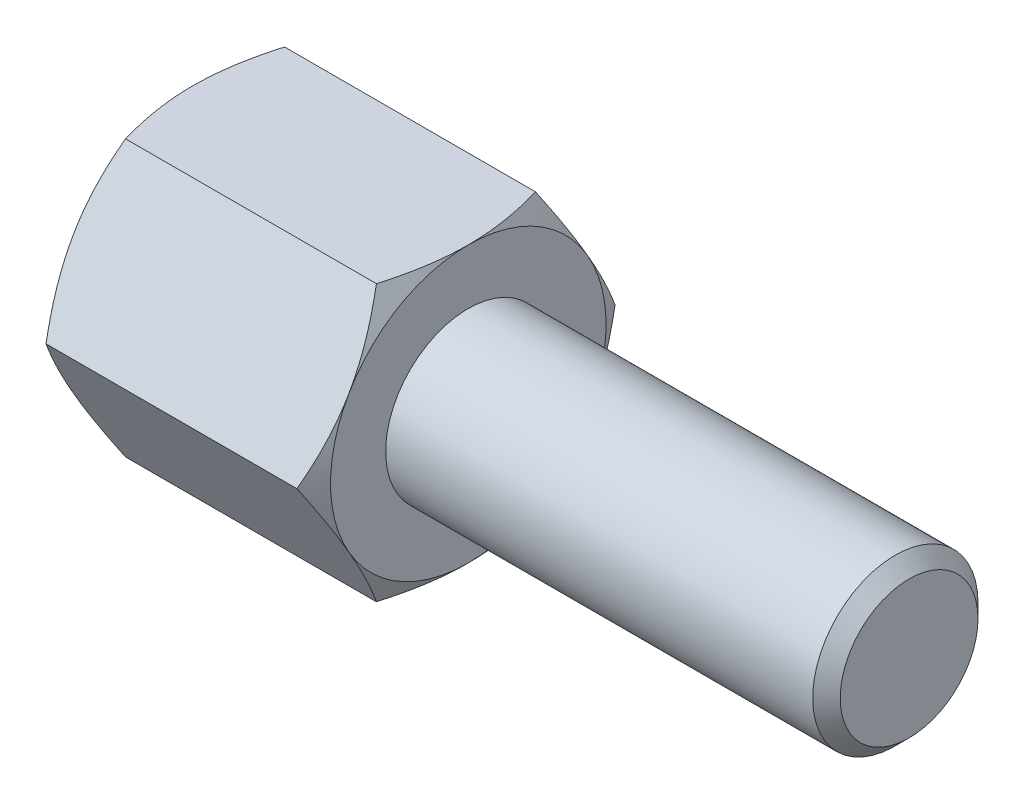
ISO-10303-21;
HEADER;
FILE_DESCRIPTION(('STEP AP214'),'2;1');
FILE_NAME('part.step','',(''),(''),'','','');
FILE_SCHEMA(('AUTOMOTIVE_DESIGN { 1 0 10303 214 1 1 1 1 }'));
ENDSEC;
DATA;
#1=APPLICATION_CONTEXT('core data for automotive mechanical design processes');
#2=APPLICATION_PROTOCOL_DEFINITION('international standard','automotive_design',2000,#1);
#3=PRODUCT_CONTEXT('',#1,'mechanical');
#4=PRODUCT('Part','Part','',(#3));
#5=PRODUCT_RELATED_PRODUCT_CATEGORY('part','',(#4));
#6=PRODUCT_DEFINITION_FORMATION('','',#4);
#7=PRODUCT_DEFINITION_CONTEXT('part definition',#1,'design');
#8=PRODUCT_DEFINITION('design','',#6,#7);
#9=PRODUCT_DEFINITION_SHAPE('','',#8);
#10=(LENGTH_UNIT() NAMED_UNIT(*) SI_UNIT(.MILLI.,.METRE.));
#11=(NAMED_UNIT(*) PLANE_ANGLE_UNIT() SI_UNIT($,.RADIAN.));
#12=(NAMED_UNIT(*) SI_UNIT($,.STERADIAN.) SOLID_ANGLE_UNIT());
#13=UNCERTAINTY_MEASURE_WITH_UNIT(LENGTH_MEASURE(1.E-05),#10,'distance_accuracy_value','');
#14=(GEOMETRIC_REPRESENTATION_CONTEXT(3) GLOBAL_UNCERTAINTY_ASSIGNED_CONTEXT((#13)) GLOBAL_UNIT_ASSIGNED_CONTEXT((#10,
#11,#12)) REPRESENTATION_CONTEXT('',''));
#15=CARTESIAN_POINT('',(0.,0.,0.));
#16=DIRECTION('',(0.,0.,1.));
#17=DIRECTION('',(1.,0.,0.));
#18=AXIS2_PLACEMENT_3D('',#15,#16,#17);
#19=CARTESIAN_POINT('',(2.5,2.5,-1.44337567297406));
#20=DIRECTION('',(1.,0.,0.));
#21=DIRECTION('',(0.,0.,-1.));
#22=AXIS2_PLACEMENT_3D('',#19,#20,#21);
#23=PLANE('',#22);
#24=CARTESIAN_POINT('',(2.5,0.,0.));
#25=DIRECTION('',(1.,0.,0.));
#26=DIRECTION('',(0.,0.,-1.));
#27=AXIS2_PLACEMENT_3D('',#24,#25,#26);
#28=CIRCLE('',#27,2.5);
#29=CARTESIAN_POINT('',(2.5,-1.25,-2.1650635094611));
#30=VERTEX_POINT('',#29);
#31=CARTESIAN_POINT('',(2.5,1.25,-2.1650635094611));
#32=VERTEX_POINT('',#31);
#33=EDGE_CURVE('E288',#30,#32,#28,.T.);
#34=ORIENTED_EDGE('',*,*,#33,.T.);
#35=CARTESIAN_POINT('',(2.5,2.5,0.));
#36=VERTEX_POINT('',#35);
#37=EDGE_CURVE('E53',#32,#36,#28,.T.);
#38=ORIENTED_EDGE('',*,*,#37,.T.);
#39=CARTESIAN_POINT('',(2.5,1.25,2.1650635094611));
#40=VERTEX_POINT('',#39);
#41=EDGE_CURVE('E297',#36,#40,#28,.T.);
#42=ORIENTED_EDGE('',*,*,#41,.T.);
#43=CARTESIAN_POINT('',(2.5,-1.25,2.1650635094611));
#44=VERTEX_POINT('',#43);
#45=EDGE_CURVE('E302',#40,#44,#28,.T.);
#46=ORIENTED_EDGE('',*,*,#45,.T.);
#47=CARTESIAN_POINT('',(2.5,0.,0.));
#48=DIRECTION('',(-1.,0.,0.));
#49=DIRECTION('',(0.,-1.,0.));
#50=AXIS2_PLACEMENT_3D('',#47,#48,#49);
#51=CIRCLE('',#50,2.5);
#52=CARTESIAN_POINT('',(2.5,-2.5,0.));
#53=VERTEX_POINT('',#52);
#54=EDGE_CURVE('E193',#53,#44,#51,.T.);
#55=ORIENTED_EDGE('',*,*,#54,.F.);
#56=EDGE_CURVE('E61',#53,#30,#28,.T.);
#57=ORIENTED_EDGE('',*,*,#56,.T.);
#58=EDGE_LOOP('',(#34,#38,#42,#46,#55,#57));
#59=FACE_BOUND('',#58,.T.);
#60=CARTESIAN_POINT('',(2.5,0.,0.));
#61=DIRECTION('',(1.,0.,0.));
#62=DIRECTION('',(0.,0.,-1.));
#63=AXIS2_PLACEMENT_3D('',#60,#61,#62);
#64=CIRCLE('',#63,1.5);
#65=CARTESIAN_POINT('',(2.5,0.,-1.5));
#66=VERTEX_POINT('',#65);
#67=EDGE_CURVE('E314',#66,#66,#64,.T.);
#68=ORIENTED_EDGE('',*,*,#67,.F.);
#69=EDGE_LOOP('',(#68));
#70=FACE_BOUND('',#69,.T.);
#71=ADVANCED_FACE('F37',(#59,#70),#23,.T.);
#72=CARTESIAN_POINT('',(2.5,0.,-2.88675134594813));
#73=DIRECTION('',(0.,-0.5,0.866025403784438));
#74=DIRECTION('',(0.,-0.866025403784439,-0.5));
#75=AXIS2_PLACEMENT_3D('',#72,#73,#74);
#76=PLANE('',#75);
#77=CARTESIAN_POINT('',(2.27664233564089,-0.000199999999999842,-2.88686681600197));
#78=CARTESIAN_POINT('',(2.31327837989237,0.109663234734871,-2.82343724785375));
#79=CARTESIAN_POINT('',(2.34659778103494,0.220474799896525,-2.75946016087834));
#80=CARTESIAN_POINT('',(2.40475771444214,0.444016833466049,-2.63039810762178));
#81=CARTESIAN_POINT('',(2.42957767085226,0.556751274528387,-2.5653108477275));
#82=CARTESIAN_POINT('',(2.46821434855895,0.780822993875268,-2.43594298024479));
#83=CARTESIAN_POINT('',(2.48228820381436,0.892125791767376,-2.37168227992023));
#84=CARTESIAN_POINT('',(2.49909084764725,1.11525522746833,-2.24285844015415));
#85=CARTESIAN_POINT('',(2.50183354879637,1.22708105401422,-2.17829576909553));
#86=CARTESIAN_POINT('',(2.49613423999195,1.43604197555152,-2.05765212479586));
#87=CARTESIAN_POINT('',(2.48909160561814,1.53320831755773,-2.0015531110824));
#88=CARTESIAN_POINT('',(2.46676858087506,1.726907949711,-1.88972057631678));
#89=CARTESIAN_POINT('',(2.45148056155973,1.82344056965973,-1.8339874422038));
#90=CARTESIAN_POINT('',(2.41326090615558,2.01753972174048,-1.7219242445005));
#91=CARTESIAN_POINT('',(2.39016722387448,2.11508168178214,-1.66560836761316));
#92=CARTESIAN_POINT('',(2.33775334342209,2.30871060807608,-1.55381665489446));
#93=CARTESIAN_POINT('',(2.30844546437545,2.40480005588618,-1.49833938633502));
#94=CARTESIAN_POINT('',(2.27664233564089,2.5002,-1.44326020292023));
#95=B_SPLINE_CURVE_WITH_KNOTS('',3,(#77,#78,#79,#80,#81,#82,#83,#84,#85,#86,#87,#88,#89,#90,#91,
#92,#93,#94),.UNSPECIFIED.,.F.,.F.,(4,2,2,2,2,2,2,2,4),(0.,0.396285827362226,0.79352433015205,
1.18093086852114,1.56786160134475,1.90479741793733,2.24204551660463,2.58677531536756,
2.93082800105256),.UNSPECIFIED.);
#96=CARTESIAN_POINT('',(2.2767090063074,0.,-2.88675134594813));
#97=VERTEX_POINT('',#96);
#98=EDGE_CURVE('E330',#97,#32,#95,.T.);
#99=ORIENTED_EDGE('',*,*,#98,.F.);
#100=DIRECTION('',(-1.,0.,0.));
#101=VECTOR('',#100,1.);
#102=CARTESIAN_POINT('',(2.5,0.,-2.88675134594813));
#103=LINE('',#102,#101);
#104=CARTESIAN_POINT('',(-2.2767090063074,0.,-2.88675134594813));
#105=VERTEX_POINT('',#104);
#106=EDGE_CURVE('E264',#97,#105,#103,.T.);
#107=ORIENTED_EDGE('',*,*,#106,.T.);
#108=CARTESIAN_POINT('',(-2.27664233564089,2.5002,-1.44326020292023));
#109=CARTESIAN_POINT('',(-2.31327837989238,2.39033676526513,-1.50668977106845));
#110=CARTESIAN_POINT('',(-2.34659778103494,2.27952520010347,-1.57066685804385));
#111=CARTESIAN_POINT('',(-2.40475771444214,2.05598316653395,-1.69972891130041));
#112=CARTESIAN_POINT('',(-2.42957767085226,1.94324872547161,-1.7648161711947));
#113=CARTESIAN_POINT('',(-2.46821434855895,1.71917700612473,-1.8941840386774));
#114=CARTESIAN_POINT('',(-2.48228820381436,1.60787420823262,-1.95844473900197));
#115=CARTESIAN_POINT('',(-2.49909084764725,1.38474477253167,-2.08726857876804));
#116=CARTESIAN_POINT('',(-2.50183354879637,1.27291894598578,-2.15183124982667));
#117=CARTESIAN_POINT('',(-2.49613423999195,1.06395802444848,-2.27247489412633));
#118=CARTESIAN_POINT('',(-2.48909160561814,0.966791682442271,-2.32857390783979));
#119=CARTESIAN_POINT('',(-2.46676858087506,0.773092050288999,-2.44040644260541));
#120=CARTESIAN_POINT('',(-2.45148056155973,0.676559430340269,-2.49613957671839));
#121=CARTESIAN_POINT('',(-2.41326090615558,0.482460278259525,-2.60820277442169));
#122=CARTESIAN_POINT('',(-2.39016722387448,0.38491831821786,-2.66451865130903));
#123=CARTESIAN_POINT('',(-2.33775334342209,0.191289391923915,-2.77631036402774));
#124=CARTESIAN_POINT('',(-2.30844546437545,0.0951999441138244,-2.83178763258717));
#125=CARTESIAN_POINT('',(-2.27664233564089,-0.000199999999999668,-2.88686681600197));
#126=B_SPLINE_CURVE_WITH_KNOTS('',3,(#108,#109,#110,#111,#112,#113,#114,#115,#116,#117,#118,
#119,#120,#121,#122,#123,#124,#125),.UNSPECIFIED.,.F.,.F.,(4,2,2,2,2,2,2,2,4),(0.,
0.396285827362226,0.793524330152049,1.18093086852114,1.56786160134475,1.90479741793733,
2.24204551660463,2.58677531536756,2.93082800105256),.UNSPECIFIED.);
#127=CARTESIAN_POINT('',(-2.5,1.25,-2.1650635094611));
#128=VERTEX_POINT('',#127);
#129=EDGE_CURVE('E391',#128,#105,#126,.T.);
#130=ORIENTED_EDGE('',*,*,#129,.F.);
#131=CARTESIAN_POINT('',(-2.2767090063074,2.5,-1.44337567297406));
#132=VERTEX_POINT('',#131);
#133=EDGE_CURVE('E388',#132,#128,#126,.T.);
#134=ORIENTED_EDGE('',*,*,#133,.F.);
#135=DIRECTION('',(-1.,0.,0.));
#136=VECTOR('',#135,1.);
#137=CARTESIAN_POINT('',(2.5,2.5,-1.44337567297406));
#138=LINE('',#137,#136);
#139=CARTESIAN_POINT('',(2.27670900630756,2.5,-1.44337567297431));
#140=VERTEX_POINT('',#139);
#141=EDGE_CURVE('E279',#140,#132,#138,.T.);
#142=ORIENTED_EDGE('',*,*,#141,.F.);
#143=EDGE_CURVE('E229',#32,#140,#95,.T.);
#144=ORIENTED_EDGE('',*,*,#143,.F.);
#145=EDGE_LOOP('',(#99,#107,#130,#134,#142,#144));
#146=FACE_BOUND('',#145,.T.);
#147=ADVANCED_FACE('F148',(#146),#76,.F.);
#148=CARTESIAN_POINT('',(2.5,2.5,-1.44337567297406));
#149=DIRECTION('',(0.,-1.,0.));
#150=DIRECTION('',(0.,0.,-1.));
#151=AXIS2_PLACEMENT_3D('',#148,#149,#150);
#152=PLANE('',#151);
#153=CARTESIAN_POINT('',(1.26803388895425,2.5,-3.90158441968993));
#154=CARTESIAN_POINT('',(1.32120772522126,2.5,-3.79217004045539));
#155=CARTESIAN_POINT('',(1.37387869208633,2.5,-3.68250707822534));
#156=CARTESIAN_POINT('',(1.47793249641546,2.5,-3.46255185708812));
#157=CARTESIAN_POINT('',(1.52931513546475,2.5,-3.35225950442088));
#158=CARTESIAN_POINT('',(1.63076309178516,2.5,-3.130356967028));
#159=CARTESIAN_POINT('',(1.68081992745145,2.5,-3.01874289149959));
#160=CARTESIAN_POINT('',(1.77891712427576,2.5,-2.79463535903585));
#161=CARTESIAN_POINT('',(1.82695757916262,2.5,-2.68214194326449));
#162=CARTESIAN_POINT('',(1.92201845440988,2.5,-2.45240385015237));
#163=CARTESIAN_POINT('',(1.96895431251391,2.5,-2.33512399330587));
#164=CARTESIAN_POINT('',(2.05933269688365,2.5,-2.09920133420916));
#165=CARTESIAN_POINT('',(2.10277483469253,2.5,-1.98055838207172));
#166=CARTESIAN_POINT('',(2.18504351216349,2.5,-1.74193489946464));
#167=CARTESIAN_POINT('',(2.22387917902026,2.5,-1.6219575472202));
#168=CARTESIAN_POINT('',(2.29570507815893,2.5,-1.38028205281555));
#169=CARTESIAN_POINT('',(2.32869712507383,2.5,-1.25858445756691));
#170=CARTESIAN_POINT('',(2.38709594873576,2.5,-1.01406369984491));
#171=CARTESIAN_POINT('',(2.4125437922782,2.5,-0.891250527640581));
#172=CARTESIAN_POINT('',(2.45442751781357,2.5,-0.64407172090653));
#173=CARTESIAN_POINT('',(2.47086432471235,2.5,-0.519706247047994));
#174=CARTESIAN_POINT('',(2.4932006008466,2.5,-0.271679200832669));
#175=CARTESIAN_POINT('',(2.49923751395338,2.5,-0.148030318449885));
#176=CARTESIAN_POINT('',(2.50062561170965,2.5,0.0993395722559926));
#177=CARTESIAN_POINT('',(2.49597656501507,2.5,0.223060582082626));
#178=CARTESIAN_POINT('',(2.47940443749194,2.5,0.432351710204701));
#179=CARTESIAN_POINT('',(2.47010665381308,2.5,0.518143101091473));
#180=CARTESIAN_POINT('',(2.44693847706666,2.5,0.689112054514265));
#181=CARTESIAN_POINT('',(2.43306748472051,2.5,0.774289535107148));
#182=CARTESIAN_POINT('',(2.38532020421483,2.5,1.02876599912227));
#183=CARTESIAN_POINT('',(2.34531764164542,2.5,1.19691958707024));
#184=CARTESIAN_POINT('',(2.25226567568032,2.5,1.53362893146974));
#185=CARTESIAN_POINT('',(2.19893620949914,2.5,1.70210423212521));
#186=CARTESIAN_POINT('',(2.11237169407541,2.5,1.95247339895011));
#187=CARTESIAN_POINT('',(2.08242477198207,2.5,2.03553184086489));
#188=CARTESIAN_POINT('',(2.02068409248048,2.5,2.20095860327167));
#189=CARTESIAN_POINT('',(1.98889037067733,2.5,2.2833269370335));
#190=CARTESIAN_POINT('',(1.90401426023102,2.5,2.49723312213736));
#191=CARTESIAN_POINT('',(1.84971733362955,2.5,2.6282879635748));
#192=CARTESIAN_POINT('',(1.73812739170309,2.5,2.8891203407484));
#193=CARTESIAN_POINT('',(1.6808341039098,2.5,3.01889775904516));
#194=CARTESIAN_POINT('',(1.56393487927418,2.5,3.27745045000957));
#195=CARTESIAN_POINT('',(1.50432825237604,2.5,3.40622540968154));
#196=CARTESIAN_POINT('',(1.3833234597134,2.5,3.66293235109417));
#197=CARTESIAN_POINT('',(1.32192524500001,2.5,3.79086430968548));
#198=CARTESIAN_POINT('',(1.1354580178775,2.5,4.17399495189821));
#199=CARTESIAN_POINT('',(1.00828249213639,2.5,4.42816724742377));
#200=CARTESIAN_POINT('',(0.750345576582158,2.5,4.93461464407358));
#201=CARTESIAN_POINT('',(0.619584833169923,2.5,5.18689007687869));
#202=CARTESIAN_POINT('',(0.36871001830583,2.5,5.66512451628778));
#203=CARTESIAN_POINT('',(0.248829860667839,2.5,5.89120644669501));
#204=CARTESIAN_POINT('',(0.00759021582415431,2.5,6.34259369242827));
#205=CARTESIAN_POINT('',(-0.113769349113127,2.5,6.56789896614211));
#206=CARTESIAN_POINT('',(-0.357219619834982,2.5,7.01722044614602));
#207=CARTESIAN_POINT('',(-0.479306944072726,2.5,7.24123848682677));
#208=CARTESIAN_POINT('',(-0.72433375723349,2.5,7.68878772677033));
#209=CARTESIAN_POINT('',(-0.847273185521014,2.5,7.9123189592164));
#210=CARTESIAN_POINT('',(-0.970524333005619,2.5,8.13567697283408));
#211=B_SPLINE_CURVE_WITH_KNOTS('',3,(#153,#154,#155,#156,#157,#158,#159,#160,#161,#162,#163,
#164,#165,#166,#167,#168,#169,#170,#171,#172,#173,#174,#175,#176,#177,#178,#179,#180,#181,#182,
#183,#184,#185,#186,#187,#188,#189,#190,#191,#192,#193,#194,#195,#196,#197,#198,#199,#200,#201,
#202,#203,#204,#205,#206,#207,#208,#209,#210),.UNSPECIFIED.,.F.,.F.,(4,2,2,2,2,2,2,2,2,2,2,2,2,
2,2,2,2,2,2,2,2,2,2,2,2,2,2,2,4),(0.,0.364957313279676,0.729970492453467,1.09692930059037,
1.46387103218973,1.84279746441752,2.22176597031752,2.59997058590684,2.97805755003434,
3.35404692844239,3.72999770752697,4.10094071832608,4.47189175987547,4.73064905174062,
4.98944026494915,5.50729076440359,6.03710483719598,6.30196454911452,6.56681915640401,
6.99233818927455,7.417895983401,7.84358170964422,8.26927907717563,9.12186602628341,
9.97430025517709,10.7419897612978,11.5097197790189,12.2750964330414,13.0404191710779),.UNSPECIFIED.);
#212=EDGE_CURVE('E227',#140,#36,#211,.T.);
#213=ORIENTED_EDGE('',*,*,#212,.F.);
#214=ORIENTED_EDGE('',*,*,#141,.T.);
#215=CARTESIAN_POINT('',(-1.26803388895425,2.5,-3.90158441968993));
#216=CARTESIAN_POINT('',(-1.32120772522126,2.5,-3.79217004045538));
#217=CARTESIAN_POINT('',(-1.37387869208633,2.5,-3.68250707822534));
#218=CARTESIAN_POINT('',(-1.47793249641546,2.5,-3.46255185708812));
#219=CARTESIAN_POINT('',(-1.52931513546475,2.5,-3.35225950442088));
#220=CARTESIAN_POINT('',(-1.63076309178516,2.5,-3.130356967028));
#221=CARTESIAN_POINT('',(-1.68081992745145,2.5,-3.01874289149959));
#222=CARTESIAN_POINT('',(-1.77891712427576,2.5,-2.79463535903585));
#223=CARTESIAN_POINT('',(-1.82695757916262,2.5,-2.68214194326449));
#224=CARTESIAN_POINT('',(-1.92201845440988,2.5,-2.45240385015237));
#225=CARTESIAN_POINT('',(-1.96895431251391,2.5,-2.33512399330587));
#226=CARTESIAN_POINT('',(-2.05933269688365,2.5,-2.09920133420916));
#227=CARTESIAN_POINT('',(-2.10277483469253,2.5,-1.98055838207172));
#228=CARTESIAN_POINT('',(-2.18504351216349,2.5,-1.74193489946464));
#229=CARTESIAN_POINT('',(-2.22387917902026,2.5,-1.6219575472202));
#230=CARTESIAN_POINT('',(-2.29570507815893,2.5,-1.38028205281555));
#231=CARTESIAN_POINT('',(-2.32869712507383,2.5,-1.25858445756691));
#232=CARTESIAN_POINT('',(-2.38709594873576,2.5,-1.01406369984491));
#233=CARTESIAN_POINT('',(-2.4125437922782,2.5,-0.891250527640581));
#234=CARTESIAN_POINT('',(-2.45442751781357,2.5,-0.64407172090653));
#235=CARTESIAN_POINT('',(-2.47086432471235,2.5,-0.519706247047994));
#236=CARTESIAN_POINT('',(-2.4932006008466,2.5,-0.271679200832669));
#237=CARTESIAN_POINT('',(-2.49923751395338,2.5,-0.148030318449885));
#238=CARTESIAN_POINT('',(-2.50062561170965,2.5,0.0993395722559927));
#239=CARTESIAN_POINT('',(-2.49597656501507,2.5,0.223060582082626));
#240=CARTESIAN_POINT('',(-2.47940443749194,2.5,0.432351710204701));
#241=CARTESIAN_POINT('',(-2.47010665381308,2.5,0.518143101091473));
#242=CARTESIAN_POINT('',(-2.44693847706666,2.5,0.689112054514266));
#243=CARTESIAN_POINT('',(-2.43306748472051,2.5,0.774289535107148));
#244=CARTESIAN_POINT('',(-2.38532020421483,2.5,1.02876599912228));
#245=CARTESIAN_POINT('',(-2.34531764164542,2.5,1.19691958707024));
#246=CARTESIAN_POINT('',(-2.25226567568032,2.5,1.53362893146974));
#247=CARTESIAN_POINT('',(-2.19893620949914,2.5,1.70210423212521));
#248=CARTESIAN_POINT('',(-2.11237169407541,2.5,1.95247339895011));
#249=CARTESIAN_POINT('',(-2.08242477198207,2.5,2.03553184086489));
#250=CARTESIAN_POINT('',(-2.02068409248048,2.5,2.20095860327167));
#251=CARTESIAN_POINT('',(-1.98889037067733,2.5,2.2833269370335));
#252=CARTESIAN_POINT('',(-1.90401426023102,2.5,2.49723312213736));
#253=CARTESIAN_POINT('',(-1.84971733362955,2.5,2.6282879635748));
#254=CARTESIAN_POINT('',(-1.73812739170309,2.5,2.88912034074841));
#255=CARTESIAN_POINT('',(-1.6808341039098,2.5,3.01889775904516));
#256=CARTESIAN_POINT('',(-1.56393487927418,2.5,3.27745045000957));
#257=CARTESIAN_POINT('',(-1.50432825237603,2.5,3.40622540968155));
#258=CARTESIAN_POINT('',(-1.38332345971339,2.5,3.66293235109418));
#259=CARTESIAN_POINT('',(-1.32192524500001,2.5,3.79086430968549));
#260=CARTESIAN_POINT('',(-1.1354580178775,2.5,4.17399495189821));
#261=CARTESIAN_POINT('',(-1.00828249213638,2.5,4.42816724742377));
#262=CARTESIAN_POINT('',(-0.750345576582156,2.5,4.93461464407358));
#263=CARTESIAN_POINT('',(-0.619584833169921,2.5,5.18689007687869));
#264=CARTESIAN_POINT('',(-0.368710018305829,2.5,5.66512451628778));
#265=CARTESIAN_POINT('',(-0.248829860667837,2.5,5.89120644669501));
#266=CARTESIAN_POINT('',(-0.00759021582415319,2.5,6.34259369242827));
#267=CARTESIAN_POINT('',(0.113769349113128,2.5,6.56789896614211));
#268=CARTESIAN_POINT('',(0.357219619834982,2.5,7.01722044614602));
#269=CARTESIAN_POINT('',(0.479306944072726,2.5,7.24123848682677));
#270=CARTESIAN_POINT('',(0.72433375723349,2.5,7.68878772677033));
#271=CARTESIAN_POINT('',(0.847273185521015,2.5,7.9123189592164));
#272=CARTESIAN_POINT('',(0.970524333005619,2.5,8.13567697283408));
#273=B_SPLINE_CURVE_WITH_KNOTS('',3,(#215,#216,#217,#218,#219,#220,#221,#222,#223,#224,#225,
#226,#227,#228,#229,#230,#231,#232,#233,#234,#235,#236,#237,#238,#239,#240,#241,#242,#243,#244,
#245,#246,#247,#248,#249,#250,#251,#252,#253,#254,#255,#256,#257,#258,#259,#260,#261,#262,#263,
#264,#265,#266,#267,#268,#269,#270,#271,#272),.UNSPECIFIED.,.F.,.F.,(4,2,2,2,2,2,2,2,2,2,2,2,2,
2,2,2,2,2,2,2,2,2,2,2,2,2,2,2,4),(0.,0.364957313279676,0.729970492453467,1.09692930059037,
1.46387103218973,1.84279746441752,2.22176597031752,2.59997058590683,2.97805755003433,
3.35404692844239,3.72999770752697,4.10094071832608,4.47189175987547,4.73064905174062,
4.98944026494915,5.50729076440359,6.03710483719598,6.30196454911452,6.56681915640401,
6.99233818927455,7.41789598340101,7.84358170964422,8.26927907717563,9.12186602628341,
9.97430025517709,10.7419897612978,11.5097197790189,12.2750964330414,13.0404191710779),.UNSPECIFIED.);
#274=CARTESIAN_POINT('',(-2.5,2.5,0.));
#275=VERTEX_POINT('',#274);
#276=EDGE_CURVE('E241',#275,#132,#273,.F.);
#277=ORIENTED_EDGE('',*,*,#276,.F.);
#278=CARTESIAN_POINT('',(-2.2767090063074,2.5,1.44337567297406));
#279=VERTEX_POINT('',#278);
#280=EDGE_CURVE('E249',#279,#275,#273,.F.);
#281=ORIENTED_EDGE('',*,*,#280,.F.);
#282=DIRECTION('',(-1.,0.,0.));
#283=VECTOR('',#282,1.);
#284=CARTESIAN_POINT('',(2.5,2.5,1.44337567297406));
#285=LINE('',#284,#283);
#286=CARTESIAN_POINT('',(2.2767090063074,2.5,1.44337567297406));
#287=VERTEX_POINT('',#286);
#288=EDGE_CURVE('E276',#287,#279,#285,.T.);
#289=ORIENTED_EDGE('',*,*,#288,.F.);
#290=EDGE_CURVE('E221',#36,#287,#211,.T.);
#291=ORIENTED_EDGE('',*,*,#290,.F.);
#292=EDGE_LOOP('',(#213,#214,#277,#281,#289,#291));
#293=FACE_BOUND('',#292,.T.);
#294=ADVANCED_FACE('F153',(#293),#152,.F.);
#295=CARTESIAN_POINT('',(2.5,2.5,1.44337567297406));
#296=DIRECTION('',(0.,-0.5,-0.866025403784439));
#297=DIRECTION('',(0.,0.866025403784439,-0.5));
#298=AXIS2_PLACEMENT_3D('',#295,#296,#297);
#299=PLANE('',#298);
#300=CARTESIAN_POINT('',(2.27664233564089,2.5002,1.44326020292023));
#301=CARTESIAN_POINT('',(2.31327837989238,2.39033676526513,1.50668977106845));
#302=CARTESIAN_POINT('',(2.34659778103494,2.27952520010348,1.57066685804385));
#303=CARTESIAN_POINT('',(2.40475771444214,2.05598316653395,1.69972891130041));
#304=CARTESIAN_POINT('',(2.42957767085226,1.94324872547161,1.7648161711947));
#305=CARTESIAN_POINT('',(2.46821434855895,1.71917700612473,1.8941840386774));
#306=CARTESIAN_POINT('',(2.48228820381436,1.60787420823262,1.95844473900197));
#307=CARTESIAN_POINT('',(2.49909084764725,1.38474477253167,2.08726857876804));
#308=CARTESIAN_POINT('',(2.50183354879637,1.27291894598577,2.15183124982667));
#309=CARTESIAN_POINT('',(2.49613423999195,1.06395802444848,2.27247489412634));
#310=CARTESIAN_POINT('',(2.48909160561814,0.96679168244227,2.32857390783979));
#311=CARTESIAN_POINT('',(2.46676858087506,0.773092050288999,2.44040644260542));
#312=CARTESIAN_POINT('',(2.45148056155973,0.676559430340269,2.49613957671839));
#313=CARTESIAN_POINT('',(2.41326090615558,0.482460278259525,2.60820277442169));
#314=CARTESIAN_POINT('',(2.39016722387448,0.384918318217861,2.66451865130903));
#315=CARTESIAN_POINT('',(2.33775334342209,0.191289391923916,2.77631036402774));
#316=CARTESIAN_POINT('',(2.30844546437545,0.0951999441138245,2.83178763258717));
#317=CARTESIAN_POINT('',(2.27664233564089,-0.00019999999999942,2.88686681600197));
#318=B_SPLINE_CURVE_WITH_KNOTS('',3,(#300,#301,#302,#303,#304,#305,#306,#307,#308,#309,#310,
#311,#312,#313,#314,#315,#316,#317),.UNSPECIFIED.,.F.,.F.,(4,2,2,2,2,2,2,2,4),(0.,
0.396285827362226,0.79352433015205,1.18093086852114,1.56786160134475,1.90479741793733,
2.24204551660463,2.58677531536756,2.93082800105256),.UNSPECIFIED.);
#319=EDGE_CURVE('E228',#287,#40,#318,.T.);
#320=ORIENTED_EDGE('',*,*,#319,.F.);
#321=ORIENTED_EDGE('',*,*,#288,.T.);
#322=CARTESIAN_POINT('',(-2.27664233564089,-0.000199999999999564,2.88686681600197));
#323=CARTESIAN_POINT('',(-2.31327837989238,0.109663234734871,2.82343724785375));
#324=CARTESIAN_POINT('',(-2.34659778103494,0.220474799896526,2.75946016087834));
#325=CARTESIAN_POINT('',(-2.40475771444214,0.44401683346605,2.63039810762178));
#326=CARTESIAN_POINT('',(-2.42957767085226,0.556751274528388,2.5653108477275));
#327=CARTESIAN_POINT('',(-2.46821434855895,0.780822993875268,2.43594298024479));
#328=CARTESIAN_POINT('',(-2.48228820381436,0.892125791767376,2.37168227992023));
#329=CARTESIAN_POINT('',(-2.49909084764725,1.11525522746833,2.24285844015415));
#330=CARTESIAN_POINT('',(-2.50183354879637,1.22708105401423,2.17829576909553));
#331=CARTESIAN_POINT('',(-2.49613423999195,1.43604197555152,2.05765212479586));
#332=CARTESIAN_POINT('',(-2.48909160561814,1.53320831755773,2.0015531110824));
#333=CARTESIAN_POINT('',(-2.46676858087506,1.726907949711,1.88972057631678));
#334=CARTESIAN_POINT('',(-2.45148056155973,1.82344056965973,1.8339874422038));
#335=CARTESIAN_POINT('',(-2.41326090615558,2.01753972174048,1.7219242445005));
#336=CARTESIAN_POINT('',(-2.39016722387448,2.11508168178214,1.66560836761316));
#337=CARTESIAN_POINT('',(-2.33775334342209,2.30871060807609,1.55381665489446));
#338=CARTESIAN_POINT('',(-2.30844546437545,2.40480005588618,1.49833938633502));
#339=CARTESIAN_POINT('',(-2.27664233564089,2.5002,1.44326020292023));
#340=B_SPLINE_CURVE_WITH_KNOTS('',3,(#322,#323,#324,#325,#326,#327,#328,#329,#330,#331,#332,
#333,#334,#335,#336,#337,#338,#339),.UNSPECIFIED.,.F.,.F.,(4,2,2,2,2,2,2,2,4),(0.,
0.396285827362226,0.793524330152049,1.18093086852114,1.56786160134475,1.90479741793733,
2.24204551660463,2.58677531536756,2.93082800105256),.UNSPECIFIED.);
#341=CARTESIAN_POINT('',(-2.5,1.25,2.1650635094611));
#342=VERTEX_POINT('',#341);
#343=EDGE_CURVE('E255',#342,#279,#340,.T.);
#344=ORIENTED_EDGE('',*,*,#343,.F.);
#345=CARTESIAN_POINT('',(-2.2767090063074,0.,2.88675134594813));
#346=VERTEX_POINT('',#345);
#347=EDGE_CURVE('E262',#346,#342,#340,.T.);
#348=ORIENTED_EDGE('',*,*,#347,.F.);
#349=DIRECTION('',(-1.,0.,0.));
#350=VECTOR('',#349,1.);
#351=CARTESIAN_POINT('',(2.5,0.,2.88675134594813));
#352=LINE('',#351,#350);
#353=CARTESIAN_POINT('',(2.2767090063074,0.,2.88675134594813));
#354=VERTEX_POINT('',#353);
#355=EDGE_CURVE('E273',#354,#346,#352,.T.);
#356=ORIENTED_EDGE('',*,*,#355,.F.);
#357=EDGE_CURVE('E215',#40,#354,#318,.T.);
#358=ORIENTED_EDGE('',*,*,#357,.F.);
#359=EDGE_LOOP('',(#320,#321,#344,#348,#356,#358));
#360=FACE_BOUND('',#359,.T.);
#361=ADVANCED_FACE('F235',(#360),#299,.F.);
#362=CARTESIAN_POINT('',(2.5,0.,2.88675134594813));
#363=DIRECTION('',(0.,0.5,-0.866025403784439));
#364=DIRECTION('',(0.,0.866025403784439,0.5));
#365=AXIS2_PLACEMENT_3D('',#362,#363,#364);
#366=PLANE('',#365);
#367=CARTESIAN_POINT('',(2.27664233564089,0.000200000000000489,2.88686681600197));
#368=CARTESIAN_POINT('',(2.31327837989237,-0.10966323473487,2.82343724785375));
#369=CARTESIAN_POINT('',(2.34659778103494,-0.220474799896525,2.75946016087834));
#370=CARTESIAN_POINT('',(2.40475771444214,-0.444016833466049,2.63039810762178));
#371=CARTESIAN_POINT('',(2.42957767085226,-0.556751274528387,2.5653108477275));
#372=CARTESIAN_POINT('',(2.46821434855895,-0.780822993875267,2.43594298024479));
#373=CARTESIAN_POINT('',(2.48228820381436,-0.892125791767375,2.37168227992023));
#374=CARTESIAN_POINT('',(2.49909084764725,-1.11525522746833,2.24285844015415));
#375=CARTESIAN_POINT('',(2.50183354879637,-1.22708105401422,2.17829576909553));
#376=CARTESIAN_POINT('',(2.49613423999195,-1.43604197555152,2.05765212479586));
#377=CARTESIAN_POINT('',(2.48909160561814,-1.53320831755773,2.0015531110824));
#378=CARTESIAN_POINT('',(2.46676858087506,-1.726907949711,1.88972057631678));
#379=CARTESIAN_POINT('',(2.45148056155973,-1.82344056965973,1.8339874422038));
#380=CARTESIAN_POINT('',(2.41326090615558,-2.01753972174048,1.7219242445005));
#381=CARTESIAN_POINT('',(2.39016722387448,-2.11508168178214,1.66560836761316));
#382=CARTESIAN_POINT('',(2.33775334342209,-2.30871060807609,1.55381665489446));
#383=CARTESIAN_POINT('',(2.30844546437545,-2.40480005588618,1.49833938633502));
#384=CARTESIAN_POINT('',(2.27664233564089,-2.5002,1.44326020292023));
#385=B_SPLINE_CURVE_WITH_KNOTS('',3,(#367,#368,#369,#370,#371,#372,#373,#374,#375,#376,#377,
#378,#379,#380,#381,#382,#383,#384),.UNSPECIFIED.,.F.,.F.,(4,2,2,2,2,2,2,2,4),(0.,
0.396285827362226,0.793524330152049,1.18093086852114,1.56786160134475,1.90479741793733,
2.24204551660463,2.58677531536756,2.93082800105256),.UNSPECIFIED.);
#386=EDGE_CURVE('E413',#354,#44,#385,.T.);
#387=ORIENTED_EDGE('',*,*,#386,.F.);
#388=ORIENTED_EDGE('',*,*,#355,.T.);
#389=CARTESIAN_POINT('',(-2.27664233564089,-2.5002,1.44326020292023));
#390=CARTESIAN_POINT('',(-2.31327837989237,-2.39033676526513,1.50668977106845));
#391=CARTESIAN_POINT('',(-2.34659778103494,-2.27952520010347,1.57066685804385));
#392=CARTESIAN_POINT('',(-2.40475771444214,-2.05598316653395,1.69972891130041));
#393=CARTESIAN_POINT('',(-2.42957767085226,-1.94324872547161,1.7648161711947));
#394=CARTESIAN_POINT('',(-2.46821434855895,-1.71917700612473,1.8941840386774));
#395=CARTESIAN_POINT('',(-2.48228820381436,-1.60787420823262,1.95844473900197));
#396=CARTESIAN_POINT('',(-2.49909084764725,-1.38474477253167,2.08726857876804));
#397=CARTESIAN_POINT('',(-2.50183354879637,-1.27291894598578,2.15183124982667));
#398=CARTESIAN_POINT('',(-2.49613423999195,-1.06395802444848,2.27247489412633));
#399=CARTESIAN_POINT('',(-2.48909160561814,-0.966791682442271,2.32857390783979));
#400=CARTESIAN_POINT('',(-2.46676858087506,-0.773092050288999,2.44040644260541));
#401=CARTESIAN_POINT('',(-2.45148056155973,-0.676559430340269,2.49613957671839));
#402=CARTESIAN_POINT('',(-2.41326090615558,-0.482460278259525,2.60820277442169));
#403=CARTESIAN_POINT('',(-2.39016722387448,-0.38491831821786,2.66451865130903));
#404=CARTESIAN_POINT('',(-2.33775334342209,-0.191289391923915,2.77631036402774));
#405=CARTESIAN_POINT('',(-2.30844546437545,-0.0951999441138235,2.83178763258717));
#406=CARTESIAN_POINT('',(-2.27664233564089,0.000200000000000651,2.88686681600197));
#407=B_SPLINE_CURVE_WITH_KNOTS('',3,(#389,#390,#391,#392,#393,#394,#395,#396,#397,#398,#399,
#400,#401,#402,#403,#404,#405,#406),.UNSPECIFIED.,.F.,.F.,(4,2,2,2,2,2,2,2,4),(0.,
0.396285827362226,0.793524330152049,1.18093086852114,1.56786160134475,1.90479741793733,
2.24204551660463,2.58677531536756,2.93082800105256),.UNSPECIFIED.);
#408=CARTESIAN_POINT('',(-2.5,-1.25,2.1650635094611));
#409=VERTEX_POINT('',#408);
#410=EDGE_CURVE('E263',#409,#346,#407,.T.);
#411=ORIENTED_EDGE('',*,*,#410,.F.);
#412=CARTESIAN_POINT('',(-2.2767090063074,-2.5,1.44337567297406));
#413=VERTEX_POINT('',#412);
#414=EDGE_CURVE('E250',#413,#409,#407,.T.);
#415=ORIENTED_EDGE('',*,*,#414,.F.);
#416=DIRECTION('',(-1.,0.,0.));
#417=VECTOR('',#416,1.);
#418=CARTESIAN_POINT('',(2.5,-2.5,1.44337567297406));
#419=LINE('',#418,#417);
#420=CARTESIAN_POINT('',(2.2767090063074,-2.5,1.44337567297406));
#421=VERTEX_POINT('',#420);
#422=EDGE_CURVE('E270',#421,#413,#419,.T.);
#423=ORIENTED_EDGE('',*,*,#422,.F.);
#424=EDGE_CURVE('E210',#44,#421,#385,.T.);
#425=ORIENTED_EDGE('',*,*,#424,.F.);
#426=EDGE_LOOP('',(#387,#388,#411,#415,#423,#425));
#427=FACE_BOUND('',#426,.T.);
#428=ADVANCED_FACE('F378',(#427),#366,.F.);
#429=CARTESIAN_POINT('',(2.5,-2.5,1.44337567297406));
#430=DIRECTION('',(0.,1.,0.));
#431=DIRECTION('',(0.,0.,1.));
#432=AXIS2_PLACEMENT_3D('',#429,#430,#431);
#433=PLANE('',#432);
#434=CARTESIAN_POINT('',(1.26803388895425,-2.5,-3.90158441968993));
#435=CARTESIAN_POINT('',(1.32120772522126,-2.5,-3.79217004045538));
#436=CARTESIAN_POINT('',(1.37387869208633,-2.5,-3.68250707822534));
#437=CARTESIAN_POINT('',(1.47793249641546,-2.5,-3.46255185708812));
#438=CARTESIAN_POINT('',(1.52931513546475,-2.5,-3.35225950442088));
#439=CARTESIAN_POINT('',(1.63076309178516,-2.5,-3.130356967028));
#440=CARTESIAN_POINT('',(1.68081992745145,-2.5,-3.01874289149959));
#441=CARTESIAN_POINT('',(1.77891712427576,-2.5,-2.79463535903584));
#442=CARTESIAN_POINT('',(1.82695757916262,-2.5,-2.68214194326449));
#443=CARTESIAN_POINT('',(1.92201845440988,-2.5,-2.45240385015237));
#444=CARTESIAN_POINT('',(1.96895431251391,-2.5,-2.33512399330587));
#445=CARTESIAN_POINT('',(2.05933269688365,-2.5,-2.09920133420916));
#446=CARTESIAN_POINT('',(2.10277483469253,-2.5,-1.98055838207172));
#447=CARTESIAN_POINT('',(2.18504351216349,-2.5,-1.74193489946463));
#448=CARTESIAN_POINT('',(2.22387917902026,-2.5,-1.6219575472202));
#449=CARTESIAN_POINT('',(2.29570507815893,-2.5,-1.38028205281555));
#450=CARTESIAN_POINT('',(2.32869712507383,-2.5,-1.25858445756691));
#451=CARTESIAN_POINT('',(2.38709594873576,-2.5,-1.01406369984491));
#452=CARTESIAN_POINT('',(2.4125437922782,-2.5,-0.891250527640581));
#453=CARTESIAN_POINT('',(2.45442751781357,-2.5,-0.64407172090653));
#454=CARTESIAN_POINT('',(2.47086432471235,-2.5,-0.519706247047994));
#455=CARTESIAN_POINT('',(2.49320060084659,-2.5,-0.271679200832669));
#456=CARTESIAN_POINT('',(2.49923751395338,-2.5,-0.148030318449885));
#457=CARTESIAN_POINT('',(2.50062561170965,-2.5,0.0993395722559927));
#458=CARTESIAN_POINT('',(2.49597656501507,-2.5,0.223060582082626));
#459=CARTESIAN_POINT('',(2.47940443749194,-2.5,0.4323517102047));
#460=CARTESIAN_POINT('',(2.47010665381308,-2.5,0.518143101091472));
#461=CARTESIAN_POINT('',(2.44693847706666,-2.5,0.689112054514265));
#462=CARTESIAN_POINT('',(2.43306748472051,-2.5,0.774289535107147));
#463=CARTESIAN_POINT('',(2.38532020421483,-2.5,1.02876599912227));
#464=CARTESIAN_POINT('',(2.34531764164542,-2.5,1.19691958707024));
#465=CARTESIAN_POINT('',(2.25226567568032,-2.5,1.53362893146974));
#466=CARTESIAN_POINT('',(2.19893620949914,-2.5,1.70210423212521));
#467=CARTESIAN_POINT('',(2.11237169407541,-2.5,1.95247339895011));
#468=CARTESIAN_POINT('',(2.08242477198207,-2.5,2.03553184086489));
#469=CARTESIAN_POINT('',(2.02068409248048,-2.5,2.20095860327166));
#470=CARTESIAN_POINT('',(1.98889037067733,-2.5,2.28332693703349));
#471=CARTESIAN_POINT('',(1.90401426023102,-2.5,2.49723312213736));
#472=CARTESIAN_POINT('',(1.84971733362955,-2.5,2.6282879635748));
#473=CARTESIAN_POINT('',(1.73812739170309,-2.5,2.8891203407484));
#474=CARTESIAN_POINT('',(1.6808341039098,-2.5,3.01889775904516));
#475=CARTESIAN_POINT('',(1.56393487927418,-2.5,3.27745045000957));
#476=CARTESIAN_POINT('',(1.50432825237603,-2.5,3.40622540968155));
#477=CARTESIAN_POINT('',(1.38332345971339,-2.5,3.66293235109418));
#478=CARTESIAN_POINT('',(1.32192524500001,-2.5,3.79086430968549));
#479=CARTESIAN_POINT('',(1.1354580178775,-2.5,4.17399495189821));
#480=CARTESIAN_POINT('',(1.00828249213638,-2.5,4.42816724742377));
#481=CARTESIAN_POINT('',(0.750345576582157,-2.5,4.93461464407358));
#482=CARTESIAN_POINT('',(0.619584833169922,-2.5,5.18689007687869));
#483=CARTESIAN_POINT('',(0.368710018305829,-2.5,5.66512451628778));
#484=CARTESIAN_POINT('',(0.248829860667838,-2.5,5.89120644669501));
#485=CARTESIAN_POINT('',(0.00759021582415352,-2.5,6.34259369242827));
#486=CARTESIAN_POINT('',(-0.113769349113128,-2.5,6.56789896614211));
#487=CARTESIAN_POINT('',(-0.357219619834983,-2.5,7.01722044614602));
#488=CARTESIAN_POINT('',(-0.479306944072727,-2.5,7.24123848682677));
#489=CARTESIAN_POINT('',(-0.724333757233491,-2.5,7.68878772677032));
#490=CARTESIAN_POINT('',(-0.847273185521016,-2.5,7.9123189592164));
#491=CARTESIAN_POINT('',(-0.970524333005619,-2.5,8.13567697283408));
#492=B_SPLINE_CURVE_WITH_KNOTS('',3,(#434,#435,#436,#437,#438,#439,#440,#441,#442,#443,#444,
#445,#446,#447,#448,#449,#450,#451,#452,#453,#454,#455,#456,#457,#458,#459,#460,#461,#462,#463,
#464,#465,#466,#467,#468,#469,#470,#471,#472,#473,#474,#475,#476,#477,#478,#479,#480,#481,#482,
#483,#484,#485,#486,#487,#488,#489,#490,#491),.UNSPECIFIED.,.F.,.F.,(4,2,2,2,2,2,2,2,2,2,2,2,2,
2,2,2,2,2,2,2,2,2,2,2,2,2,2,2,4),(0.,0.364957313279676,0.729970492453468,1.09692930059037,
1.46387103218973,1.84279746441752,2.22176597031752,2.59997058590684,2.97805755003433,
3.35404692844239,3.72999770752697,4.10094071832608,4.47189175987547,4.73064905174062,
4.98944026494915,5.50729076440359,6.03710483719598,6.30196454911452,6.56681915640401,
6.99233818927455,7.417895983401,7.84358170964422,8.26927907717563,9.12186602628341,
9.97430025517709,10.7419897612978,11.5097197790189,12.2750964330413,13.0404191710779),.UNSPECIFIED.);
#493=EDGE_CURVE('E411',#421,#53,#492,.F.);
#494=ORIENTED_EDGE('',*,*,#493,.F.);
#495=ORIENTED_EDGE('',*,*,#422,.T.);
#496=CARTESIAN_POINT('',(-1.26803388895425,-2.5,-3.90158441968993));
#497=CARTESIAN_POINT('',(-1.32120772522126,-2.5,-3.79217004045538));
#498=CARTESIAN_POINT('',(-1.37387869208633,-2.5,-3.68250707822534));
#499=CARTESIAN_POINT('',(-1.47793249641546,-2.5,-3.46255185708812));
#500=CARTESIAN_POINT('',(-1.52931513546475,-2.5,-3.35225950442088));
#501=CARTESIAN_POINT('',(-1.63076309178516,-2.5,-3.130356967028));
#502=CARTESIAN_POINT('',(-1.68081992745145,-2.5,-3.01874289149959));
#503=CARTESIAN_POINT('',(-1.77891712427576,-2.5,-2.79463535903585));
#504=CARTESIAN_POINT('',(-1.82695757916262,-2.5,-2.68214194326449));
#505=CARTESIAN_POINT('',(-1.92201845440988,-2.5,-2.45240385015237));
#506=CARTESIAN_POINT('',(-1.96895431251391,-2.5,-2.33512399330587));
#507=CARTESIAN_POINT('',(-2.05933269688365,-2.5,-2.09920133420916));
#508=CARTESIAN_POINT('',(-2.10277483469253,-2.5,-1.98055838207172));
#509=CARTESIAN_POINT('',(-2.18504351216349,-2.5,-1.74193489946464));
#510=CARTESIAN_POINT('',(-2.22387917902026,-2.5,-1.6219575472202));
#511=CARTESIAN_POINT('',(-2.29570507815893,-2.5,-1.38028205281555));
#512=CARTESIAN_POINT('',(-2.32869712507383,-2.5,-1.25858445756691));
#513=CARTESIAN_POINT('',(-2.38709594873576,-2.5,-1.01406369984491));
#514=CARTESIAN_POINT('',(-2.4125437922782,-2.5,-0.891250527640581));
#515=CARTESIAN_POINT('',(-2.45442751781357,-2.5,-0.64407172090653));
#516=CARTESIAN_POINT('',(-2.47086432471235,-2.5,-0.519706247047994));
#517=CARTESIAN_POINT('',(-2.49320060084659,-2.5,-0.271679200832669));
#518=CARTESIAN_POINT('',(-2.49923751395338,-2.5,-0.148030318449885));
#519=CARTESIAN_POINT('',(-2.50062561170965,-2.5,0.0993395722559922));
#520=CARTESIAN_POINT('',(-2.49597656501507,-2.5,0.223060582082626));
#521=CARTESIAN_POINT('',(-2.47940443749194,-2.5,0.432351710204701));
#522=CARTESIAN_POINT('',(-2.47010665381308,-2.5,0.518143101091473));
#523=CARTESIAN_POINT('',(-2.44693847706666,-2.5,0.689112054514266));
#524=CARTESIAN_POINT('',(-2.43306748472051,-2.5,0.774289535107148));
#525=CARTESIAN_POINT('',(-2.38532020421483,-2.5,1.02876599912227));
#526=CARTESIAN_POINT('',(-2.34531764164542,-2.5,1.19691958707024));
#527=CARTESIAN_POINT('',(-2.25226567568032,-2.5,1.53362893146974));
#528=CARTESIAN_POINT('',(-2.19893620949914,-2.5,1.70210423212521));
#529=CARTESIAN_POINT('',(-2.11237169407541,-2.5,1.95247339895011));
#530=CARTESIAN_POINT('',(-2.08242477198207,-2.5,2.03553184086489));
#531=CARTESIAN_POINT('',(-2.02068409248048,-2.5,2.20095860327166));
#532=CARTESIAN_POINT('',(-1.98889037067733,-2.5,2.28332693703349));
#533=CARTESIAN_POINT('',(-1.90401426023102,-2.5,2.49723312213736));
#534=CARTESIAN_POINT('',(-1.84971733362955,-2.5,2.6282879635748));
#535=CARTESIAN_POINT('',(-1.73812739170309,-2.5,2.8891203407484));
#536=CARTESIAN_POINT('',(-1.6808341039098,-2.5,3.01889775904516));
#537=CARTESIAN_POINT('',(-1.56393487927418,-2.5,3.27745045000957));
#538=CARTESIAN_POINT('',(-1.50432825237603,-2.5,3.40622540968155));
#539=CARTESIAN_POINT('',(-1.38332345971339,-2.5,3.66293235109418));
#540=CARTESIAN_POINT('',(-1.32192524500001,-2.5,3.79086430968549));
#541=CARTESIAN_POINT('',(-1.1354580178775,-2.5,4.17399495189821));
#542=CARTESIAN_POINT('',(-1.00828249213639,-2.5,4.42816724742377));
#543=CARTESIAN_POINT('',(-0.750345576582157,-2.5,4.93461464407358));
#544=CARTESIAN_POINT('',(-0.619584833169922,-2.5,5.18689007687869));
#545=CARTESIAN_POINT('',(-0.368710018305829,-2.5,5.66512451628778));
#546=CARTESIAN_POINT('',(-0.248829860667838,-2.5,5.89120644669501));
#547=CARTESIAN_POINT('',(-0.00759021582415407,-2.5,6.34259369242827));
#548=CARTESIAN_POINT('',(0.113769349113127,-2.5,6.5678989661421));
#549=CARTESIAN_POINT('',(0.357219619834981,-2.5,7.01722044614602));
#550=CARTESIAN_POINT('',(0.479306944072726,-2.5,7.24123848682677));
#551=CARTESIAN_POINT('',(0.724333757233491,-2.5,7.68878772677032));
#552=CARTESIAN_POINT('',(0.847273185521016,-2.5,7.9123189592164));
#553=CARTESIAN_POINT('',(0.970524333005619,-2.5,8.13567697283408));
#554=B_SPLINE_CURVE_WITH_KNOTS('',3,(#496,#497,#498,#499,#500,#501,#502,#503,#504,#505,#506,
#507,#508,#509,#510,#511,#512,#513,#514,#515,#516,#517,#518,#519,#520,#521,#522,#523,#524,#525,
#526,#527,#528,#529,#530,#531,#532,#533,#534,#535,#536,#537,#538,#539,#540,#541,#542,#543,#544,
#545,#546,#547,#548,#549,#550,#551,#552,#553),.UNSPECIFIED.,.F.,.F.,(4,2,2,2,2,2,2,2,2,2,2,2,2,
2,2,2,2,2,2,2,2,2,2,2,2,2,2,2,4),(0.,0.364957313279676,0.729970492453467,1.09692930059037,
1.46387103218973,1.84279746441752,2.22176597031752,2.59997058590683,2.97805755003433,
3.35404692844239,3.72999770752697,4.10094071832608,4.47189175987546,4.73064905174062,
4.98944026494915,5.50729076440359,6.03710483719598,6.30196454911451,6.56681915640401,
6.99233818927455,7.417895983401,7.84358170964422,8.26927907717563,9.1218660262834,
9.97430025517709,10.7419897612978,11.5097197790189,12.2750964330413,13.0404191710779),.UNSPECIFIED.);
#555=CARTESIAN_POINT('',(-2.5,-2.5,0.));
#556=VERTEX_POINT('',#555);
#557=EDGE_CURVE('E386',#556,#413,#554,.T.);
#558=ORIENTED_EDGE('',*,*,#557,.F.);
#559=CARTESIAN_POINT('',(-2.2767090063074,-2.5,-1.44337567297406));
#560=VERTEX_POINT('',#559);
#561=EDGE_CURVE('E355',#560,#556,#554,.T.);
#562=ORIENTED_EDGE('',*,*,#561,.F.);
#563=DIRECTION('',(-1.,0.,0.));
#564=VECTOR('',#563,1.);
#565=CARTESIAN_POINT('',(2.5,-2.5,-1.44337567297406));
#566=LINE('',#565,#564);
#567=CARTESIAN_POINT('',(2.2767090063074,-2.5,-1.44337567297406));
#568=VERTEX_POINT('',#567);
#569=EDGE_CURVE('E267',#568,#560,#566,.T.);
#570=ORIENTED_EDGE('',*,*,#569,.F.);
#571=EDGE_CURVE('E195',#53,#568,#492,.F.);
#572=ORIENTED_EDGE('',*,*,#571,.F.);
#573=EDGE_LOOP('',(#494,#495,#558,#562,#570,#572));
#574=FACE_BOUND('',#573,.T.);
#575=ADVANCED_FACE('F172',(#574),#433,.F.);
#576=CARTESIAN_POINT('',(2.5,-2.5,-1.44337567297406));
#577=DIRECTION('',(0.,0.5,0.866025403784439));
#578=DIRECTION('',(0.,-0.866025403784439,0.5));
#579=AXIS2_PLACEMENT_3D('',#576,#577,#578);
#580=PLANE('',#579);
#581=CARTESIAN_POINT('',(2.27664233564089,-2.5002,-1.44326020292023));
#582=CARTESIAN_POINT('',(2.31327837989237,-2.39033676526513,-1.50668977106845));
#583=CARTESIAN_POINT('',(2.34659778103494,-2.27952520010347,-1.57066685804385));
#584=CARTESIAN_POINT('',(2.40475771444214,-2.05598316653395,-1.69972891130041));
#585=CARTESIAN_POINT('',(2.42957767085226,-1.94324872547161,-1.7648161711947));
#586=CARTESIAN_POINT('',(2.46821434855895,-1.71917700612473,-1.8941840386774));
#587=CARTESIAN_POINT('',(2.48228820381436,-1.60787420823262,-1.95844473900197));
#588=CARTESIAN_POINT('',(2.49909084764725,-1.38474477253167,-2.08726857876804));
#589=CARTESIAN_POINT('',(2.50183354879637,-1.27291894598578,-2.15183124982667));
#590=CARTESIAN_POINT('',(2.49613423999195,-1.06395802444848,-2.27247489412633));
#591=CARTESIAN_POINT('',(2.48909160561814,-0.966791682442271,-2.32857390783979));
#592=CARTESIAN_POINT('',(2.46676858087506,-0.773092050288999,-2.44040644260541));
#593=CARTESIAN_POINT('',(2.45148056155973,-0.676559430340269,-2.49613957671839));
#594=CARTESIAN_POINT('',(2.41326090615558,-0.482460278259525,-2.60820277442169));
#595=CARTESIAN_POINT('',(2.39016722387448,-0.38491831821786,-2.66451865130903));
#596=CARTESIAN_POINT('',(2.33775334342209,-0.191289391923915,-2.77631036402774));
#597=CARTESIAN_POINT('',(2.30844546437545,-0.0951999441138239,-2.83178763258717));
#598=CARTESIAN_POINT('',(2.27664233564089,0.000200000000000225,-2.88686681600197));
#599=B_SPLINE_CURVE_WITH_KNOTS('',3,(#581,#582,#583,#584,#585,#586,#587,#588,#589,#590,#591,
#592,#593,#594,#595,#596,#597,#598),.UNSPECIFIED.,.F.,.F.,(4,2,2,2,2,2,2,2,4),(0.,
0.396285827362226,0.793524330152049,1.18093086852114,1.56786160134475,1.90479741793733,
2.24204551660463,2.58677531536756,2.93082800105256),.UNSPECIFIED.);
#600=EDGE_CURVE('E192',#568,#30,#599,.T.);
#601=ORIENTED_EDGE('',*,*,#600,.F.);
#602=ORIENTED_EDGE('',*,*,#569,.T.);
#603=CARTESIAN_POINT('',(-2.27664233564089,0.000200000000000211,-2.88686681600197));
#604=CARTESIAN_POINT('',(-2.31327837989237,-0.109663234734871,-2.82343724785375));
#605=CARTESIAN_POINT('',(-2.34659778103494,-0.220474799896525,-2.75946016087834));
#606=CARTESIAN_POINT('',(-2.40475771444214,-0.444016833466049,-2.63039810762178));
#607=CARTESIAN_POINT('',(-2.42957767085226,-0.556751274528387,-2.5653108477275));
#608=CARTESIAN_POINT('',(-2.46821434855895,-0.780822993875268,-2.43594298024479));
#609=CARTESIAN_POINT('',(-2.48228820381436,-0.892125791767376,-2.37168227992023));
#610=CARTESIAN_POINT('',(-2.49909084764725,-1.11525522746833,-2.24285844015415));
#611=CARTESIAN_POINT('',(-2.50183354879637,-1.22708105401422,-2.17829576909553));
#612=CARTESIAN_POINT('',(-2.49613423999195,-1.43604197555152,-2.05765212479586));
#613=CARTESIAN_POINT('',(-2.48909160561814,-1.53320831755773,-2.0015531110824));
#614=CARTESIAN_POINT('',(-2.46676858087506,-1.726907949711,-1.88972057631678));
#615=CARTESIAN_POINT('',(-2.45148056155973,-1.82344056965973,-1.8339874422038));
#616=CARTESIAN_POINT('',(-2.41326090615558,-2.01753972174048,-1.7219242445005));
#617=CARTESIAN_POINT('',(-2.39016722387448,-2.11508168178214,-1.66560836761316));
#618=CARTESIAN_POINT('',(-2.33775334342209,-2.30871060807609,-1.55381665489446));
#619=CARTESIAN_POINT('',(-2.30844546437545,-2.40480005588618,-1.49833938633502));
#620=CARTESIAN_POINT('',(-2.27664233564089,-2.5002,-1.44326020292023));
#621=B_SPLINE_CURVE_WITH_KNOTS('',3,(#603,#604,#605,#606,#607,#608,#609,#610,#611,#612,#613,
#614,#615,#616,#617,#618,#619,#620),.UNSPECIFIED.,.F.,.F.,(4,2,2,2,2,2,2,2,4),(0.,
0.396285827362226,0.79352433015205,1.18093086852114,1.56786160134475,1.90479741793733,
2.24204551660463,2.58677531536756,2.93082800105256),.UNSPECIFIED.);
#622=CARTESIAN_POINT('',(-2.5,-1.25,-2.1650635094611));
#623=VERTEX_POINT('',#622);
#624=EDGE_CURVE('E178',#623,#560,#621,.T.);
#625=ORIENTED_EDGE('',*,*,#624,.F.);
#626=EDGE_CURVE('E363',#105,#623,#621,.T.);
#627=ORIENTED_EDGE('',*,*,#626,.F.);
#628=ORIENTED_EDGE('',*,*,#106,.F.);
#629=EDGE_CURVE('E185',#30,#97,#599,.T.);
#630=ORIENTED_EDGE('',*,*,#629,.F.);
#631=EDGE_LOOP('',(#601,#602,#625,#627,#628,#630));
#632=FACE_BOUND('',#631,.T.);
#633=ADVANCED_FACE('F167',(#632),#580,.F.);
#634=CARTESIAN_POINT('',(-2.5,0.,0.));
#635=DIRECTION('',(1.,0.,0.));
#636=DIRECTION('',(0.,1.,0.));
#637=AXIS2_PLACEMENT_3D('',#634,#635,#636);
#638=CONICAL_SURFACE('',#637,2.5,1.0471975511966);
#639=ORIENTED_EDGE('',*,*,#129,.T.);
#640=ORIENTED_EDGE('',*,*,#626,.T.);
#641=CARTESIAN_POINT('',(-2.5,0.,0.));
#642=DIRECTION('',(1.,0.,0.));
#643=DIRECTION('',(0.,0.,-1.));
#644=AXIS2_PLACEMENT_3D('',#641,#642,#643);
#645=CIRCLE('',#644,2.5);
#646=EDGE_CURVE('E282',#623,#128,#645,.T.);
#647=ORIENTED_EDGE('',*,*,#646,.T.);
#648=EDGE_LOOP('',(#639,#640,#647));
#649=FACE_BOUND('',#648,.T.);
#650=ADVANCED_FACE('F171',(#649),#638,.T.);
#651=ORIENTED_EDGE('',*,*,#561,.T.);
#652=EDGE_CURVE('E286',#556,#623,#645,.T.);
#653=ORIENTED_EDGE('',*,*,#652,.T.);
#654=ORIENTED_EDGE('',*,*,#624,.T.);
#655=EDGE_LOOP('',(#651,#653,#654));
#656=FACE_BOUND('',#655,.T.);
#657=ADVANCED_FACE('F353',(#656),#638,.T.);
#658=ORIENTED_EDGE('',*,*,#414,.T.);
#659=CARTESIAN_POINT('',(-2.5,0.,0.));
#660=DIRECTION('',(-1.,0.,0.));
#661=DIRECTION('',(0.,-1.,0.));
#662=AXIS2_PLACEMENT_3D('',#659,#660,#661);
#663=CIRCLE('',#662,2.5);
#664=EDGE_CURVE('E331',#556,#409,#663,.T.);
#665=ORIENTED_EDGE('',*,*,#664,.F.);
#666=ORIENTED_EDGE('',*,*,#557,.T.);
#667=EDGE_LOOP('',(#658,#665,#666));
#668=FACE_BOUND('',#667,.T.);
#669=ADVANCED_FACE('F446',(#668),#638,.T.);
#670=ORIENTED_EDGE('',*,*,#347,.T.);
#671=EDGE_CURVE('E339',#342,#409,#645,.T.);
#672=ORIENTED_EDGE('',*,*,#671,.T.);
#673=ORIENTED_EDGE('',*,*,#410,.T.);
#674=EDGE_LOOP('',(#670,#672,#673));
#675=FACE_BOUND('',#674,.T.);
#676=ADVANCED_FACE('F158',(#675),#638,.T.);
#677=ORIENTED_EDGE('',*,*,#343,.T.);
#678=ORIENTED_EDGE('',*,*,#280,.T.);
#679=EDGE_CURVE('E333',#275,#342,#645,.T.);
#680=ORIENTED_EDGE('',*,*,#679,.T.);
#681=EDGE_LOOP('',(#677,#678,#680));
#682=FACE_BOUND('',#681,.T.);
#683=ADVANCED_FACE('F445',(#682),#638,.T.);
#684=ORIENTED_EDGE('',*,*,#276,.T.);
#685=ORIENTED_EDGE('',*,*,#133,.T.);
#686=EDGE_CURVE('E287',#128,#275,#645,.T.);
#687=ORIENTED_EDGE('',*,*,#686,.T.);
#688=EDGE_LOOP('',(#684,#685,#687));
#689=FACE_BOUND('',#688,.T.);
#690=ADVANCED_FACE('F165',(#689),#638,.T.);
#691=CARTESIAN_POINT('',(-2.5,2.5,-1.44337567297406));
#692=DIRECTION('',(1.,0.,0.));
#693=DIRECTION('',(0.,0.,-1.));
#694=AXIS2_PLACEMENT_3D('',#691,#692,#693);
#695=PLANE('',#694);
#696=CARTESIAN_POINT('',(-2.5,0.,0.));
#697=DIRECTION('',(-1.,0.,0.));
#698=DIRECTION('',(0.,0.,1.));
#699=AXIS2_PLACEMENT_3D('',#696,#697,#698);
#700=CIRCLE('',#699,1.25);
#701=CARTESIAN_POINT('',(-2.5,0.,1.25));
#702=VERTEX_POINT('',#701);
#703=EDGE_CURVE('E316',#702,#702,#700,.T.);
#704=ORIENTED_EDGE('',*,*,#703,.F.);
#705=EDGE_LOOP('',(#704));
#706=FACE_BOUND('',#705,.T.);
#707=ORIENTED_EDGE('',*,*,#686,.F.);
#708=ORIENTED_EDGE('',*,*,#646,.F.);
#709=ORIENTED_EDGE('',*,*,#652,.F.);
#710=ORIENTED_EDGE('',*,*,#664,.T.);
#711=ORIENTED_EDGE('',*,*,#671,.F.);
#712=ORIENTED_EDGE('',*,*,#679,.F.);
#713=EDGE_LOOP('',(#707,#708,#709,#710,#711,#712));
#714=FACE_BOUND('',#713,.T.);
#715=ADVANCED_FACE('F161',(#706,#714),#695,.F.);
#716=CARTESIAN_POINT('',(2.5,0.,0.));
#717=DIRECTION('',(-1.,0.,0.));
#718=DIRECTION('',(0.,1.,0.));
#719=AXIS2_PLACEMENT_3D('',#716,#717,#718);
#720=CONICAL_SURFACE('',#719,2.5,1.0471975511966);
#721=ORIENTED_EDGE('',*,*,#98,.T.);
#722=ORIENTED_EDGE('',*,*,#33,.F.);
#723=ORIENTED_EDGE('',*,*,#629,.T.);
#724=EDGE_LOOP('',(#721,#722,#723));
#725=FACE_BOUND('',#724,.T.);
#726=ADVANCED_FACE('F164',(#725),#720,.T.);
#727=ORIENTED_EDGE('',*,*,#571,.T.);
#728=ORIENTED_EDGE('',*,*,#600,.T.);
#729=ORIENTED_EDGE('',*,*,#56,.F.);
#730=EDGE_LOOP('',(#727,#728,#729));
#731=FACE_BOUND('',#730,.T.);
#732=ADVANCED_FACE('F202',(#731),#720,.T.);
#733=ORIENTED_EDGE('',*,*,#424,.T.);
#734=ORIENTED_EDGE('',*,*,#493,.T.);
#735=ORIENTED_EDGE('',*,*,#54,.T.);
#736=EDGE_LOOP('',(#733,#734,#735));
#737=FACE_BOUND('',#736,.T.);
#738=ADVANCED_FACE('F424',(#737),#720,.T.);
#739=ORIENTED_EDGE('',*,*,#357,.T.);
#740=ORIENTED_EDGE('',*,*,#386,.T.);
#741=ORIENTED_EDGE('',*,*,#45,.F.);
#742=EDGE_LOOP('',(#739,#740,#741));
#743=FACE_BOUND('',#742,.T.);
#744=ADVANCED_FACE('F422',(#743),#720,.T.);
#745=ORIENTED_EDGE('',*,*,#290,.T.);
#746=ORIENTED_EDGE('',*,*,#319,.T.);
#747=ORIENTED_EDGE('',*,*,#41,.F.);
#748=EDGE_LOOP('',(#745,#746,#747));
#749=FACE_BOUND('',#748,.T.);
#750=ADVANCED_FACE('F419',(#749),#720,.T.);
#751=ORIENTED_EDGE('',*,*,#143,.T.);
#752=ORIENTED_EDGE('',*,*,#212,.T.);
#753=ORIENTED_EDGE('',*,*,#37,.F.);
#754=EDGE_LOOP('',(#751,#752,#753));
#755=FACE_BOUND('',#754,.T.);
#756=ADVANCED_FACE('F143',(#755),#720,.T.);
#757=CARTESIAN_POINT('',(0.5,0.,0.));
#758=DIRECTION('',(-1.,0.,0.));
#759=DIRECTION('',(0.,0.,1.));
#760=AXIS2_PLACEMENT_3D('',#757,#758,#759);
#761=CYLINDRICAL_SURFACE('',#760,1.25);
#762=CARTESIAN_POINT('',(0.500000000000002,0.,0.));
#763=DIRECTION('',(1.,0.,0.));
#764=DIRECTION('',(0.,1.,0.));
#765=AXIS2_PLACEMENT_3D('',#762,#763,#764);
#766=CIRCLE('',#765,1.25);
#767=CARTESIAN_POINT('',(0.500000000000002,1.25,0.));
#768=VERTEX_POINT('',#767);
#769=EDGE_CURVE('E319',#768,#768,#766,.T.);
#770=ORIENTED_EDGE('',*,*,#769,.T.);
#771=EDGE_LOOP('',(#770));
#772=FACE_BOUND('',#771,.T.);
#773=ORIENTED_EDGE('',*,*,#703,.T.);
#774=EDGE_LOOP('',(#773));
#775=FACE_BOUND('',#774,.T.);
#776=ADVANCED_FACE('F133',(#772,#775),#761,.F.);
#777=CARTESIAN_POINT('',(1.22168783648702,0.,0.));
#778=DIRECTION('',(-1.,0.,0.));
#779=DIRECTION('',(0.,-1.,0.));
#780=AXIS2_PLACEMENT_3D('',#777,#778,#779);
#781=CONICAL_SURFACE('',#780,0.,1.0471975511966);
#782=ORIENTED_EDGE('',*,*,#769,.F.);
#783=EDGE_LOOP('',(#782));
#784=FACE_BOUND('',#783,.T.);
#785=CARTESIAN_POINT('',(1.22168783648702,0.,0.));
#786=VERTEX_POINT('',#785);
#787=VERTEX_LOOP('',#786);
#788=FACE_BOUND('',#787,.T.);
#789=ADVANCED_FACE('F130',(#784,#788),#781,.F.);
#790=CARTESIAN_POINT('',(10.5,0.,0.));
#791=DIRECTION('',(-1.,0.,0.));
#792=DIRECTION('',(0.,0.,1.));
#793=AXIS2_PLACEMENT_3D('',#790,#791,#792);
#794=CYLINDRICAL_SURFACE('',#793,1.5);
#795=CARTESIAN_POINT('',(10.25,0.,0.));
#796=DIRECTION('',(1.,0.,0.));
#797=DIRECTION('',(0.,0.,-1.));
#798=AXIS2_PLACEMENT_3D('',#795,#796,#797);
#799=CIRCLE('',#798,1.5);
#800=CARTESIAN_POINT('',(10.25,0.,-1.5));
#801=VERTEX_POINT('',#800);
#802=EDGE_CURVE('E11',#801,#801,#799,.F.);
#803=ORIENTED_EDGE('',*,*,#802,.T.);
#804=EDGE_LOOP('',(#803));
#805=FACE_BOUND('',#804,.T.);
#806=ORIENTED_EDGE('',*,*,#67,.T.);
#807=EDGE_LOOP('',(#806));
#808=FACE_BOUND('',#807,.T.);
#809=ADVANCED_FACE('F132',(#805,#808),#794,.T.);
#810=CARTESIAN_POINT('',(10.5,0.,0.));
#811=DIRECTION('',(1.,0.,0.));
#812=DIRECTION('',(0.,0.,-1.));
#813=AXIS2_PLACEMENT_3D('',#810,#811,#812);
#814=PLANE('',#813);
#815=CARTESIAN_POINT('',(10.5,0.,0.));
#816=DIRECTION('',(1.,0.,0.));
#817=DIRECTION('',(0.,0.,-1.));
#818=AXIS2_PLACEMENT_3D('',#815,#816,#817);
#819=CIRCLE('',#818,1.25);
#820=CARTESIAN_POINT('',(10.5,0.,-1.25));
#821=VERTEX_POINT('',#820);
#822=EDGE_CURVE('E46',#821,#821,#819,.T.);
#823=ORIENTED_EDGE('',*,*,#822,.T.);
#824=EDGE_LOOP('',(#823));
#825=FACE_BOUND('',#824,.T.);
#826=ADVANCED_FACE('F140',(#825),#814,.T.);
#827=CARTESIAN_POINT('',(10.5,0.,0.));
#828=DIRECTION('',(-1.,0.,0.));
#829=DIRECTION('',(0.,0.,1.));
#830=AXIS2_PLACEMENT_3D('',#827,#828,#829);
#831=CONICAL_SURFACE('',#830,1.25,0.785398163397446);
#832=ORIENTED_EDGE('',*,*,#802,.F.);
#833=EDGE_LOOP('',(#832));
#834=FACE_BOUND('',#833,.T.);
#835=ORIENTED_EDGE('',*,*,#822,.F.);
#836=EDGE_LOOP('',(#835));
#837=FACE_BOUND('',#836,.T.);
#838=ADVANCED_FACE('F39',(#834,#837),#831,.T.);
#839=CLOSED_SHELL('',(#71,#147,#294,#361,#428,#575,#633,#650,#657,#669,#676,#683,#690,#715,#726,
#732,#738,#744,#750,#756,#776,#789,#809,#826,#838));
#840=MANIFOLD_SOLID_BREP('B2',#839);
#841=ADVANCED_BREP_SHAPE_REPRESENTATION('',(#18,#840),#14);
#842=SHAPE_DEFINITION_REPRESENTATION(#9,#841);
ENDSEC;
END-ISO-10303-21;
